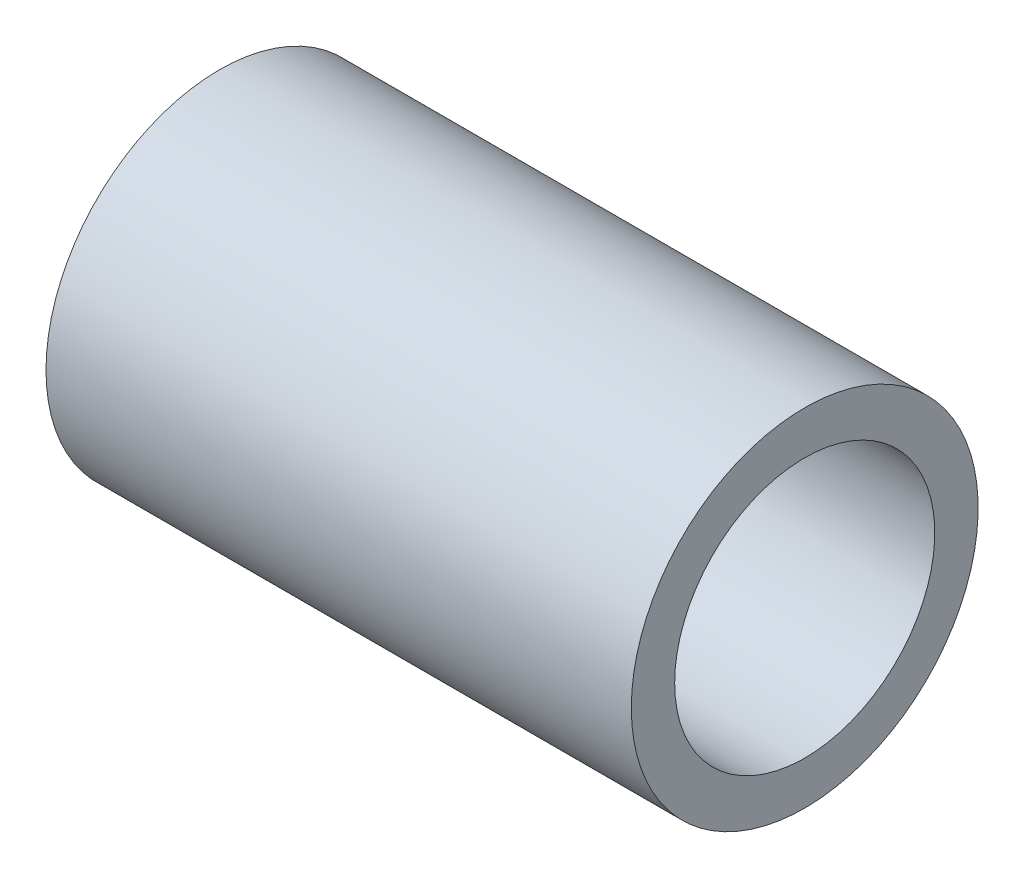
ISO-10303-21;
HEADER;
FILE_DESCRIPTION(('STEP AP214'),'2;1');
FILE_NAME('part.step','',(''),(''),'','','');
FILE_SCHEMA(('AUTOMOTIVE_DESIGN { 1 0 10303 214 1 1 1 1 }'));
ENDSEC;
DATA;
#1=APPLICATION_CONTEXT('core data for automotive mechanical design processes');
#2=APPLICATION_PROTOCOL_DEFINITION('international standard','automotive_design',2000,#1);
#3=PRODUCT_CONTEXT('',#1,'mechanical');
#4=PRODUCT('Part','Part','',(#3));
#5=PRODUCT_RELATED_PRODUCT_CATEGORY('part','',(#4));
#6=PRODUCT_DEFINITION_FORMATION('','',#4);
#7=PRODUCT_DEFINITION_CONTEXT('part definition',#1,'design');
#8=PRODUCT_DEFINITION('design','',#6,#7);
#9=PRODUCT_DEFINITION_SHAPE('','',#8);
#10=(LENGTH_UNIT() NAMED_UNIT(*) SI_UNIT(.MILLI.,.METRE.));
#11=(NAMED_UNIT(*) PLANE_ANGLE_UNIT() SI_UNIT($,.RADIAN.));
#12=(NAMED_UNIT(*) SI_UNIT($,.STERADIAN.) SOLID_ANGLE_UNIT());
#13=UNCERTAINTY_MEASURE_WITH_UNIT(LENGTH_MEASURE(1.E-05),#10,'distance_accuracy_value','');
#14=(GEOMETRIC_REPRESENTATION_CONTEXT(3) GLOBAL_UNCERTAINTY_ASSIGNED_CONTEXT((#13)) GLOBAL_UNIT_ASSIGNED_CONTEXT((#10,
#11,#12)) REPRESENTATION_CONTEXT('',''));
#15=CARTESIAN_POINT('',(0.,0.,0.));
#16=DIRECTION('',(0.,0.,1.));
#17=DIRECTION('',(1.,0.,0.));
#18=AXIS2_PLACEMENT_3D('',#15,#16,#17);
#19=CARTESIAN_POINT('',(-6.90087504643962,0.,0.));
#20=DIRECTION('',(-1.,0.,0.));
#21=DIRECTION('',(0.,0.,1.));
#22=AXIS2_PLACEMENT_3D('',#19,#20,#21);
#23=CYLINDRICAL_SURFACE('',#22,4.);
#24=DIRECTION('',(-1.,0.,0.));
#25=VECTOR('',#24,1.);
#26=CARTESIAN_POINT('',(-6.90087504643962,-1.,-3.87298334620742));
#27=LINE('',#26,#25);
#28=CARTESIAN_POINT('',(0.,-1.,-3.87298334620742));
#29=VERTEX_POINT('',#28);
#30=CARTESIAN_POINT('',(6.5,-0.999999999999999,-3.87298334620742));
#31=VERTEX_POINT('',#30);
#32=EDGE_CURVE('E71',#29,#31,#27,.F.);
#33=ORIENTED_EDGE('',*,*,#32,.T.);
#34=CARTESIAN_POINT('',(6.5,-0.999999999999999,-3.87298334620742));
#35=CARTESIAN_POINT('',(6.52766298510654,-1.00000033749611,-3.87298148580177));
#36=CARTESIAN_POINT('',(6.55531226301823,-0.998851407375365,-3.87328009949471));
#37=CARTESIAN_POINT('',(6.61040403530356,-0.994271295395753,-3.87445904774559));
#38=CARTESIAN_POINT('',(6.63784656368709,-0.990840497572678,-3.87533928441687));
#39=CARTESIAN_POINT('',(6.71945317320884,-0.977175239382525,-3.87881710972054));
#40=CARTESIAN_POINT('',(6.77305646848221,-0.963567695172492,-3.88225203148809));
#41=CARTESIAN_POINT('',(6.87712467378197,-0.927798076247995,-3.89095422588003));
#42=CARTESIAN_POINT('',(6.92758987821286,-0.905636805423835,-3.8962213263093));
#43=CARTESIAN_POINT('',(7.02411144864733,-0.853415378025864,-3.90799134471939));
#44=CARTESIAN_POINT('',(7.07016662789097,-0.823353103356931,-3.91449459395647));
#45=CARTESIAN_POINT('',(7.1575438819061,-0.755484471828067,-3.92816262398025));
#46=CARTESIAN_POINT('',(7.19875488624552,-0.717537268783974,-3.93533791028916));
#47=CARTESIAN_POINT('',(7.27430208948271,-0.635275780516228,-3.94945104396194));
#48=CARTESIAN_POINT('',(7.30863718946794,-0.590960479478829,-3.95638885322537));
#49=CARTESIAN_POINT('',(7.36991100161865,-0.496456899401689,-3.96936182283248));
#50=CARTESIAN_POINT('',(7.39673989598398,-0.446195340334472,-3.9753830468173));
#51=CARTESIAN_POINT('',(7.44152473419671,-0.341702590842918,-3.98572346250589));
#52=CARTESIAN_POINT('',(7.45948242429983,-0.287472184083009,-3.99004298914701));
#53=CARTESIAN_POINT('',(7.48565899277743,-0.177744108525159,-3.99641900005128));
#54=CARTESIAN_POINT('',(7.49406767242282,-0.122294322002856,-3.99851952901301));
#55=CARTESIAN_POINT('',(7.5015033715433,-0.0107327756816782,-4.00037438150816));
#56=CARTESIAN_POINT('',(7.50053157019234,0.0453789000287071,-4.00012899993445));
#57=CARTESIAN_POINT('',(7.48937003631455,0.155352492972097,-3.99735237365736));
#58=CARTESIAN_POINT('',(7.47938538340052,0.209236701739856,-3.99487198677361));
#59=CARTESIAN_POINT('',(7.45081132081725,0.314538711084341,-3.98796330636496));
#60=CARTESIAN_POINT('',(7.43222153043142,0.365956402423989,-3.98353492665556));
#61=CARTESIAN_POINT('',(7.38679871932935,0.46540728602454,-3.97314997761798));
#62=CARTESIAN_POINT('',(7.35989260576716,0.513405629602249,-3.96717993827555));
#63=CARTESIAN_POINT('',(7.29865687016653,0.604276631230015,-3.95435945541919));
#64=CARTESIAN_POINT('',(7.26432612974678,0.647148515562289,-3.94750887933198));
#65=CARTESIAN_POINT('',(7.18812108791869,0.727769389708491,-3.93345566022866));
#66=CARTESIAN_POINT('',(7.14606836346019,0.765349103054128,-3.92624850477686));
#67=CARTESIAN_POINT('',(7.05617013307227,0.832969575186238,-3.91246168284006));
#68=CARTESIAN_POINT('',(7.00832304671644,0.863008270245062,-3.90588218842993));
#69=CARTESIAN_POINT('',(6.90785440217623,0.914804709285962,-3.89407813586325));
#70=CARTESIAN_POINT('',(6.85520853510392,0.936517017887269,-3.88886106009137));
#71=CARTESIAN_POINT('',(6.74688307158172,0.970702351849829,-3.88047058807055));
#72=CARTESIAN_POINT('',(6.69120814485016,0.983189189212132,-3.87729413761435));
#73=CARTESIAN_POINT('',(6.6125426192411,0.993904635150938,-3.87455290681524));
#74=CARTESIAN_POINT('',(6.59008029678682,0.996190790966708,-3.8739652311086));
#75=CARTESIAN_POINT('',(6.54508221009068,0.999236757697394,-3.87318062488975));
#76=CARTESIAN_POINT('',(6.52254662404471,0.999999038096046,-3.87298306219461));
#77=CARTESIAN_POINT('',(6.5,1.,-3.87298334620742));
#78=B_SPLINE_CURVE_WITH_KNOTS('',3,(#34,#35,#36,#37,#38,#39,#40,#41,#42,#43,#44,#45,#46,#47,#48,
#49,#50,#51,#52,#53,#54,#55,#56,#57,#58,#59,#60,#61,#62,#63,#64,#65,#66,#67,#68,#69,#70,#71,#72,
#73,#74,#75,#76,#77),.UNSPECIFIED.,.F.,.F.,(4,2,2,2,2,2,2,2,2,2,2,2,2,2,2,2,2,2,2,2,2,4),(0.,
0.0829365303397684,0.16585910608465,0.331229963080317,0.496585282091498,0.66198497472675,
0.830641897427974,0.999325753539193,1.17036187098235,1.34136430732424,1.50890481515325,
1.67642426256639,1.84022545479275,2.00403389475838,2.16932509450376,2.33464120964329,
2.50441429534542,2.67423379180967,2.84496720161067,3.01544447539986,3.08315848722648,
3.15076267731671),.UNSPECIFIED.);
#79=CARTESIAN_POINT('',(6.5,1.,-3.87298334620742));
#80=VERTEX_POINT('',#79);
#81=EDGE_CURVE('E77',#31,#80,#78,.T.);
#82=ORIENTED_EDGE('',*,*,#81,.T.);
#83=DIRECTION('',(-1.,0.,0.));
#84=VECTOR('',#83,1.);
#85=CARTESIAN_POINT('',(-6.90087504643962,1.,-3.87298334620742));
#86=LINE('',#85,#84);
#87=CARTESIAN_POINT('',(0.,1.,-3.87298334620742));
#88=VERTEX_POINT('',#87);
#89=EDGE_CURVE('E91',#80,#88,#86,.T.);
#90=ORIENTED_EDGE('',*,*,#89,.T.);
#91=CARTESIAN_POINT('',(0.,0.,0.));
#92=DIRECTION('',(-1.,0.,0.));
#93=DIRECTION('',(0.,0.,1.));
#94=AXIS2_PLACEMENT_3D('',#91,#92,#93);
#95=CIRCLE('',#94,4.);
#96=EDGE_CURVE('E84',#29,#88,#95,.T.);
#97=ORIENTED_EDGE('',*,*,#96,.F.);
#98=EDGE_LOOP('',(#33,#82,#90,#97));
#99=FACE_BOUND('',#98,.T.);
#100=CARTESIAN_POINT('',(13.5,0.,0.));
#101=DIRECTION('',(-1.,0.,0.));
#102=DIRECTION('',(0.,0.,1.));
#103=AXIS2_PLACEMENT_3D('',#100,#101,#102);
#104=CIRCLE('',#103,4.);
#105=CARTESIAN_POINT('',(13.5,0.,4.));
#106=VERTEX_POINT('',#105);
#107=EDGE_CURVE('E121',#106,#106,#104,.T.);
#108=ORIENTED_EDGE('',*,*,#107,.T.);
#109=EDGE_LOOP('',(#108));
#110=FACE_BOUND('',#109,.T.);
#111=ADVANCED_FACE('F32',(#99,#110),#23,.T.);
#112=CARTESIAN_POINT('',(0.,4.,0.));
#113=DIRECTION('',(1.,0.,0.));
#114=DIRECTION('',(0.,0.,-1.));
#115=AXIS2_PLACEMENT_3D('',#112,#113,#114);
#116=PLANE('',#115);
#117=ORIENTED_EDGE('',*,*,#96,.T.);
#118=DIRECTION('',(0.,0.,1.));
#119=VECTOR('',#118,1.);
#120=CARTESIAN_POINT('',(0.,1.,-4.));
#121=LINE('',#120,#119);
#122=CARTESIAN_POINT('',(0.,1.,-2.82842712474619));
#123=VERTEX_POINT('',#122);
#124=EDGE_CURVE('E78',#88,#123,#121,.T.);
#125=ORIENTED_EDGE('',*,*,#124,.T.);
#126=CARTESIAN_POINT('',(0.,0.,0.));
#127=DIRECTION('',(-1.,0.,0.));
#128=DIRECTION('',(0.,0.,1.));
#129=AXIS2_PLACEMENT_3D('',#126,#127,#128);
#130=CIRCLE('',#129,3.);
#131=CARTESIAN_POINT('',(0.,-1.,-2.82842712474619));
#132=VERTEX_POINT('',#131);
#133=EDGE_CURVE('E86',#132,#123,#130,.T.);
#134=ORIENTED_EDGE('',*,*,#133,.F.);
#135=DIRECTION('',(0.,0.,1.));
#136=VECTOR('',#135,1.);
#137=CARTESIAN_POINT('',(0.,-1.,-4.));
#138=LINE('',#137,#136);
#139=EDGE_CURVE('E47',#29,#132,#138,.T.);
#140=ORIENTED_EDGE('',*,*,#139,.F.);
#141=EDGE_LOOP('',(#117,#125,#134,#140));
#142=FACE_BOUND('',#141,.T.);
#143=ADVANCED_FACE('F83',(#142),#116,.F.);
#144=CARTESIAN_POINT('',(-6.90087504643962,0.,0.));
#145=DIRECTION('',(-1.,0.,0.));
#146=DIRECTION('',(0.,0.,1.));
#147=AXIS2_PLACEMENT_3D('',#144,#145,#146);
#148=CYLINDRICAL_SURFACE('',#147,3.);
#149=CARTESIAN_POINT('',(13.5,0.,0.));
#150=DIRECTION('',(-1.,0.,0.));
#151=DIRECTION('',(0.,0.,1.));
#152=AXIS2_PLACEMENT_3D('',#149,#150,#151);
#153=CIRCLE('',#152,3.);
#154=CARTESIAN_POINT('',(13.5,0.,3.));
#155=VERTEX_POINT('',#154);
#156=EDGE_CURVE('E95',#155,#155,#153,.T.);
#157=ORIENTED_EDGE('',*,*,#156,.F.);
#158=EDGE_LOOP('',(#157));
#159=FACE_BOUND('',#158,.T.);
#160=ORIENTED_EDGE('',*,*,#133,.T.);
#161=DIRECTION('',(-1.,0.,0.));
#162=VECTOR('',#161,1.);
#163=CARTESIAN_POINT('',(-6.90087504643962,1.,-2.82842712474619));
#164=LINE('',#163,#162);
#165=CARTESIAN_POINT('',(6.5,1.,-2.82842712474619));
#166=VERTEX_POINT('',#165);
#167=EDGE_CURVE('E11',#123,#166,#164,.F.);
#168=ORIENTED_EDGE('',*,*,#167,.T.);
#169=CARTESIAN_POINT('',(6.5,1.,-2.82842712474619));
#170=CARTESIAN_POINT('',(6.52729049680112,1.0000007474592,-2.82842442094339));
#171=CARTESIAN_POINT('',(6.55456706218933,0.998882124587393,-2.82882259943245));
#172=CARTESIAN_POINT('',(6.6089085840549,0.994425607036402,-2.83039327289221));
#173=CARTESIAN_POINT('',(6.63597359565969,0.991088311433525,-2.83156555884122));
#174=CARTESIAN_POINT('',(6.71639214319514,0.977810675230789,-2.83619092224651));
#175=CARTESIAN_POINT('',(6.76918084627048,0.964604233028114,-2.84075292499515));
#176=CARTESIAN_POINT('',(6.87162519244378,0.929958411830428,-2.85228074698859));
#177=CARTESIAN_POINT('',(6.92128254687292,0.908523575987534,-2.85924523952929));
#178=CARTESIAN_POINT('',(7.01633983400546,0.858073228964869,-2.87478787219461));
#179=CARTESIAN_POINT('',(7.06173712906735,0.829053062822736,-2.88336700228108));
#180=CARTESIAN_POINT('',(7.14872023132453,0.763051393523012,-2.90154480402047));
#181=CARTESIAN_POINT('',(7.19011488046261,0.725824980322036,-2.91116877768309));
#182=CARTESIAN_POINT('',(7.2662060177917,0.644988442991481,-2.93013848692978));
#183=CARTESIAN_POINT('',(7.30090131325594,0.601377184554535,-2.93948417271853));
#184=CARTESIAN_POINT('',(7.3634795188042,0.507603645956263,-2.95713882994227));
#185=CARTESIAN_POINT('',(7.39116098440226,0.457300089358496,-2.96541437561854));
#186=CARTESIAN_POINT('',(7.43759225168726,0.352429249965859,-2.97969608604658));
#187=CARTESIAN_POINT('',(7.45634478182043,0.29786327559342,-2.9857029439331));
#188=CARTESIAN_POINT('',(7.48373572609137,0.188029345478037,-2.99459071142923));
#189=CARTESIAN_POINT('',(7.49270327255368,0.132851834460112,-2.99757308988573));
#190=CARTESIAN_POINT('',(7.50131629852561,0.0216989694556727,-3.00043608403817));
#191=CARTESIAN_POINT('',(7.50096399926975,-0.0342761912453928,-3.00031743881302));
#192=CARTESIAN_POINT('',(7.49115571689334,-0.143103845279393,-2.99706038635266));
#193=CARTESIAN_POINT('',(7.48205736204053,-0.195992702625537,-2.99404060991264));
#194=CARTESIAN_POINT('',(7.45560680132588,-0.299444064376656,-2.98546960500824));
#195=CARTESIAN_POINT('',(7.43825413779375,-0.350006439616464,-2.97991823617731));
#196=CARTESIAN_POINT('',(7.39557863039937,-0.448152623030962,-2.96675668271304));
#197=CARTESIAN_POINT('',(7.37015395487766,-0.495688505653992,-2.95912037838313));
#198=CARTESIAN_POINT('',(7.3121400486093,-0.585924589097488,-2.94258387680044));
#199=CARTESIAN_POINT('',(7.27954886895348,-0.628623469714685,-2.93368333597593));
#200=CARTESIAN_POINT('',(7.20632895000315,-0.710097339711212,-2.91506271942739));
#201=CARTESIAN_POINT('',(7.16539445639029,-0.748593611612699,-2.90532378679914));
#202=CARTESIAN_POINT('',(7.07755851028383,-0.818272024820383,-2.88647490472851));
#203=CARTESIAN_POINT('',(7.03065513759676,-0.849451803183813,-2.87736515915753));
#204=CARTESIAN_POINT('',(6.93131982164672,-0.904003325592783,-2.86070031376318));
#205=CARTESIAN_POINT('',(6.87881648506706,-0.927253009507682,-2.85317014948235));
#206=CARTESIAN_POINT('',(6.77035302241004,-0.964460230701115,-2.84081097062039));
#207=CARTESIAN_POINT('',(6.71439850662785,-0.978432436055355,-2.83597769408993));
#208=CARTESIAN_POINT('',(6.63158136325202,-0.991658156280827,-2.8313654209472));
#209=CARTESIAN_POINT('',(6.60535861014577,-0.994785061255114,-2.83026667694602));
#210=CARTESIAN_POINT('',(6.55276192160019,-0.998954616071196,-2.82879703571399));
#211=CARTESIAN_POINT('',(6.5263882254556,-0.999999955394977,-2.82842519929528));
#212=CARTESIAN_POINT('',(6.5,-0.999999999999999,-2.82842712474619));
#213=B_SPLINE_CURVE_WITH_KNOTS('',3,(#169,#170,#171,#172,#173,#174,#175,#176,#177,#178,#179,
#180,#181,#182,#183,#184,#185,#186,#187,#188,#189,#190,#191,#192,#193,#194,#195,#196,#197,#198,
#199,#200,#201,#202,#203,#204,#205,#206,#207,#208,#209,#210,#211,#212),.UNSPECIFIED.,.F.,.F.,(4,
2,2,2,2,2,2,2,2,2,2,2,2,2,2,2,2,2,2,2,2,4),(0.,0.0818184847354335,0.163614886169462,
0.326581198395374,0.489457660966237,0.652434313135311,0.821165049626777,0.989925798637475,
1.16309132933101,1.33620391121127,1.50329470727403,1.67034568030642,1.83084418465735,
1.99135158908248,2.15397018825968,2.31663306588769,2.4869405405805,2.65730294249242,
2.8301802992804,3.00278367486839,3.08199895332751,3.16111181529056),.UNSPECIFIED.);
#214=CARTESIAN_POINT('',(6.5,-0.999999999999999,-2.82842712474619));
#215=VERTEX_POINT('',#214);
#216=EDGE_CURVE('E40',#166,#215,#213,.T.);
#217=ORIENTED_EDGE('',*,*,#216,.T.);
#218=DIRECTION('',(-1.,0.,0.));
#219=VECTOR('',#218,1.);
#220=CARTESIAN_POINT('',(-6.90087504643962,-1.,-2.82842712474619));
#221=LINE('',#220,#219);
#222=EDGE_CURVE('E92',#215,#132,#221,.T.);
#223=ORIENTED_EDGE('',*,*,#222,.T.);
#224=EDGE_LOOP('',(#160,#168,#217,#223));
#225=FACE_BOUND('',#224,.T.);
#226=ADVANCED_FACE('F104',(#159,#225),#148,.F.);
#227=CARTESIAN_POINT('',(13.5,3.,0.));
#228=DIRECTION('',(-1.,0.,0.));
#229=DIRECTION('',(0.,0.,1.));
#230=AXIS2_PLACEMENT_3D('',#227,#228,#229);
#231=PLANE('',#230);
#232=ORIENTED_EDGE('',*,*,#107,.F.);
#233=EDGE_LOOP('',(#232));
#234=FACE_BOUND('',#233,.T.);
#235=ORIENTED_EDGE('',*,*,#156,.T.);
#236=EDGE_LOOP('',(#235));
#237=FACE_BOUND('',#236,.T.);
#238=ADVANCED_FACE('F126',(#234,#237),#231,.F.);
#239=CARTESIAN_POINT('',(0.,1.,-4.));
#240=DIRECTION('',(0.,1.,0.));
#241=DIRECTION('',(-1.,0.,0.));
#242=AXIS2_PLACEMENT_3D('',#239,#240,#241);
#243=PLANE('',#242);
#244=DIRECTION('',(0.,0.,1.));
#245=VECTOR('',#244,1.);
#246=CARTESIAN_POINT('',(6.5,1.,-4.));
#247=LINE('',#246,#245);
#248=EDGE_CURVE('E131',#80,#166,#247,.T.);
#249=ORIENTED_EDGE('',*,*,#248,.T.);
#250=ORIENTED_EDGE('',*,*,#167,.F.);
#251=ORIENTED_EDGE('',*,*,#124,.F.);
#252=ORIENTED_EDGE('',*,*,#89,.F.);
#253=EDGE_LOOP('',(#249,#250,#251,#252));
#254=FACE_BOUND('',#253,.T.);
#255=ADVANCED_FACE('F112',(#254),#243,.F.);
#256=CARTESIAN_POINT('',(6.5,0.,-4.));
#257=DIRECTION('',(0.,0.,1.));
#258=DIRECTION('',(1.,0.,0.));
#259=AXIS2_PLACEMENT_3D('',#256,#257,#258);
#260=CYLINDRICAL_SURFACE('',#259,1.);
#261=DIRECTION('',(0.,0.,1.));
#262=VECTOR('',#261,1.);
#263=CARTESIAN_POINT('',(6.5,-0.999999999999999,-4.));
#264=LINE('',#263,#262);
#265=EDGE_CURVE('E74',#31,#215,#264,.T.);
#266=ORIENTED_EDGE('',*,*,#265,.T.);
#267=ORIENTED_EDGE('',*,*,#216,.F.);
#268=ORIENTED_EDGE('',*,*,#248,.F.);
#269=ORIENTED_EDGE('',*,*,#81,.F.);
#270=EDGE_LOOP('',(#266,#267,#268,#269));
#271=FACE_BOUND('',#270,.T.);
#272=ADVANCED_FACE('F107',(#271),#260,.F.);
#273=CARTESIAN_POINT('',(6.5,-0.999999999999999,-4.));
#274=DIRECTION('',(0.,-1.,0.));
#275=DIRECTION('',(1.,0.,0.));
#276=AXIS2_PLACEMENT_3D('',#273,#274,#275);
#277=PLANE('',#276);
#278=ORIENTED_EDGE('',*,*,#139,.T.);
#279=ORIENTED_EDGE('',*,*,#222,.F.);
#280=ORIENTED_EDGE('',*,*,#265,.F.);
#281=ORIENTED_EDGE('',*,*,#32,.F.);
#282=EDGE_LOOP('',(#278,#279,#280,#281));
#283=FACE_BOUND('',#282,.T.);
#284=ADVANCED_FACE('F72',(#283),#277,.F.);
#285=CLOSED_SHELL('',(#111,#143,#226,#238,#255,#272,#284));
#286=MANIFOLD_SOLID_BREP('B2',#285);
#287=ADVANCED_BREP_SHAPE_REPRESENTATION('',(#18,#286),#14);
#288=SHAPE_DEFINITION_REPRESENTATION(#9,#287);
ENDSEC;
END-ISO-10303-21;
